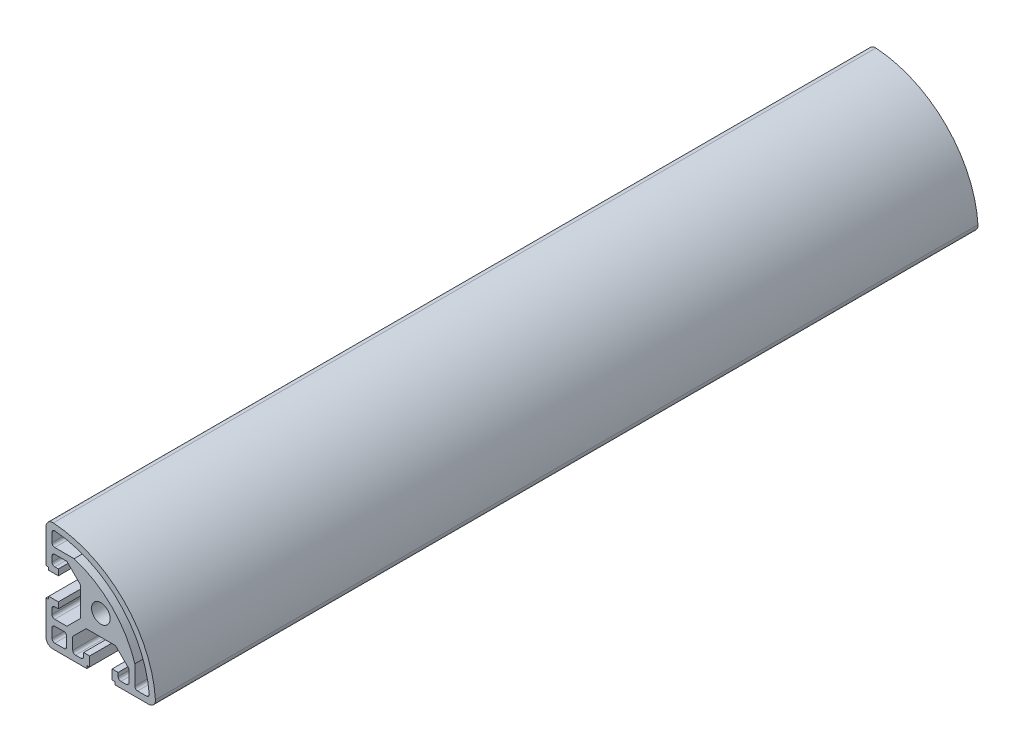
from build123d import *

# Parameters (mm, degrees)
SKETCH_1_R      = 3.4
EXTRUDE_1_DEPTH = 150


with BuildPart() as part:
    # Sketch 1 → Extrude 1 (new, symmetric)
    with BuildSketch(Plane.XY):
        with BuildLine():
            Line((-20, 17.416573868), (-20, 5.1))
            Line((-20, 5.1), (-19, 5.1))
            Line((-19, 5.1), (-19, 4.1))
            Line((-19, 4.1), (-15.5, 4.1))
            Line((-15.5, 4.1), (-15.5, 6.3))
            Line((-15.5, 6.3), (-16.8, 6.3))
            ThreePointArc((-16.8, 6.3), (-17.507106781, 6.592893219), (-17.8, 7.3))
            Line((-17.8, 7.3), (-17.8, 9.25))
            ThreePointArc((-17.8, 9.25), (-17.507106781, 9.957106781), (-16.8, 10.25))
            Line((-16.8, 10.25), (-12.371320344, 10.25))
            Line((-12.371320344, 10.25), (-7.5, 5.378679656))
            Line((-7.5, 5.378679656), (-7.5, 0))
            Line((-7.5, 0), (-7.5, -5.378679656))
            Line((-7.5, -5.378679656), (-12.371320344, -10.25))
            Line((-12.371320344, -10.25), (-16.8, -10.25))
            ThreePointArc((-16.8, -10.25), (-17.507106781, -9.957106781), (-17.8, -9.25))
            Line((-17.8, -9.25), (-17.8, -7.3))
            ThreePointArc((-17.8, -7.3), (-17.507106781, -6.592893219), (-16.8, -6.3))
            Line((-16.8, -6.3), (-15.5, -6.3))
            Line((-15.5, -6.3), (-15.5, -4.1))
            Line((-15.5, -4.1), (-19, -4.1))
            Line((-19, -4.1), (-19, -5.1))
            Line((-19, -5.1), (-20, -5.1))
            Line((-20, -5.1), (-20, -17.5))
            ThreePointArc((-20, -17.5), (-19.267766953, -19.267766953), (-17.5, -20))
            Line((-17.5, -20), (-5.1, -20))
            Line((-5.1, -20), (-5.1, -19))
            Line((-5.1, -19), (-4.1, -19))
            Line((-4.1, -19), (-4.1, -15.5))
            Line((-4.1, -15.5), (-6.3, -15.5))
            Line((-6.3, -15.5), (-6.3, -16.8))
            ThreePointArc((-6.3, -16.8), (-6.592893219, -17.507106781), (-7.3, -17.8))
            Line((-7.3, -17.8), (-9.25, -17.8))
            ThreePointArc((-9.25, -17.8), (-9.957106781, -17.507106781), (-10.25, -16.8))
            Line((-10.25, -16.8), (-10.25, -12.371320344))
            Line((-10.25, -12.371320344), (-5.378679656, -7.5))
            Line((-5.378679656, -7.5), (0, -7.5))
            Line((0, -7.5), (5.378679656, -7.5))
            Line((5.378679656, -7.5), (10.25, -12.371320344))
            Line((10.25, -12.371320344), (10.25, -16.8))
            ThreePointArc((10.25, -16.8), (9.957106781, -17.507106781), (9.25, -17.8))
            Line((9.25, -17.8), (7.3, -17.8))
            ThreePointArc((7.3, -17.8), (6.592893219, -17.507106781), (6.3, -16.8))
            Line((6.3, -16.8), (6.3, -15.5))
            Line((6.3, -15.5), (4.1, -15.5))
            Line((4.1, -15.5), (4.1, -19))
            Line((4.1, -19), (5.1, -19))
            Line((5.1, -19), (5.1, -20))
            Line((5.1, -20), (17.416573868, -20))
            ThreePointArc((17.416573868, -20), (19.242315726, -19.207825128), (19.911012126, -17.333333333))
            ThreePointArc((19.911012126, -17.333333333), (8.284271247, 8.284271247), (-17.333333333, 19.911012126))
            ThreePointArc((-17.333333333, 19.911012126), (-19.207825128, 19.242315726), (-20, 17.416573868))
        make_face()
        Circle(SKETCH_1_R, mode=Mode.SUBTRACT)
        with BuildLine():
            Line((-17.8, -13.45), (-17.8, -16.8))
            ThreePointArc((-17.8, -16.8), (-17.507106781, -17.507106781), (-16.8, -17.8))
            Line((-16.8, -17.8), (-13.45, -17.8))
            ThreePointArc((-13.45, -17.8), (-12.742893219, -17.507106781), (-12.45, -16.8))
            Line((-12.45, -16.8), (-12.45, -13.45))
            ThreePointArc((-12.45, -13.45), (-12.742893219, -12.742893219), (-13.45, -12.45))
            Line((-13.45, -12.45), (-16.8, -12.45))
            ThreePointArc((-16.8, -12.45), (-17.507106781, -12.742893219), (-17.8, -13.45))
        make_face(mode=Mode.SUBTRACT)
        with BuildLine():
            Line((-17.800895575, 16.660683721), (-17.800895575, 13.411577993))
            ThreePointArc((-17.800895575, 13.411577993), (-17.508002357, 12.704471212), (-16.800895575, 12.411577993))
            Line((-16.800895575, 12.411577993), (-9.7291864, 12.411577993))
            ThreePointArc((-9.7291864, 12.411577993), (4.04163056, 4.04163056), (12.411577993, -9.7291864))
            Line((12.411577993, -9.7291864), (12.411577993, -16.800895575))
            ThreePointArc((12.411577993, -16.800895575), (12.704471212, -17.508002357), (13.411577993, -17.800895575))
            Line((13.411577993, -17.800895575), (16.660683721, -17.800895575))
            ThreePointArc((16.660683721, -17.800895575), (17.397885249, -17.476568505), (17.656897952, -16.71396339))
            ThreePointArc((17.656897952, -16.71396339), (6.728636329, 6.728636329), (-16.71396339, 17.656897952))
            ThreePointArc((-16.71396339, 17.656897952), (-17.476568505, 17.397885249), (-17.800895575, 16.660683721))
        make_face(mode=Mode.SUBTRACT)
    extrude(amount=EXTRUDE_1_DEPTH, both=True)


solid = part.part
